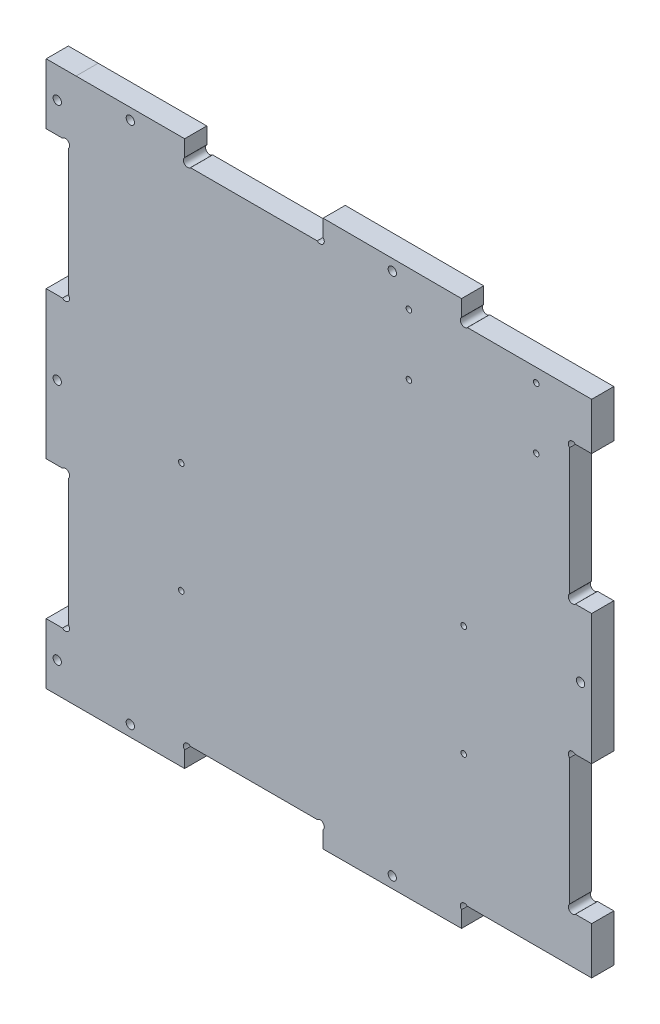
from build123d import *

# Parameters (mm, degrees)
ESQUISSE1_R        = 1
ESQUISSE1_R_2      = 1.5
ESQUISSE1_R_3      = 0.999999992
ESQUISSE1_R_4      = 0.999999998
ESQUISSE1_R_5      = 1.000000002
ESQUISSE1_R_6      = 1.499999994
ESQUISSE1_R_7      = 1.000000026
BOSS_EXTRU_1_DEPTH = 8


with BuildPart() as part:
    # Esquisse1 → Boss.-Extru.1 (new body)
    with BuildSketch(Plane.XY):
        with BuildLine():
            Line((57.310825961, 16.93251397), (11.553466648, 16.93251397))
            ThreePointArc((11.553466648, 16.93251397), (9.432146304, 16.93251397), (9.432146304, 19.053834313))
            Line((9.432146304, 19.053834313), (9.432146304, 24.932513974))
            Line((9.432146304, 24.932513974), (-29.796184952, 24.932513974))
            Line((-29.796184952, 24.932513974), (-40.567853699, 24.932512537))
            Line((-40.567853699, 24.932512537), (-40.567853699, 3.039413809))
            Line((-40.567853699, 3.039413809), (-34.68917404, 3.039413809))
            ThreePointArc((-34.68917404, 3.039413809), (-32.567718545, 3.039278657), (-32.567853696, 0.917823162))
            Line((-32.567853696, 0.917823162), (-32.567853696, -44.839349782))
            ThreePointArc((-32.567853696, -44.839349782), (-32.567853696, -46.960670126), (-34.68917404, -46.960670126))
            Line((-34.68917404, -46.960670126), (-40.567853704, -46.960670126))
            Line((-40.567853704, -46.960670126), (-40.567853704, -100.174303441))
            Line((-40.567853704, -100.174303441), (-34.68917404, -100.174303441))
            ThreePointArc((-34.68917404, -100.174303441), (-32.567853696, -100.174303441), (-32.567853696, -102.295623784))
            Line((-32.567853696, -102.295623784), (-32.567853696, -148.052796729))
            ThreePointArc((-32.567853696, -148.052796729), (-32.567718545, -150.174252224), (-34.68917404, -150.174387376))
            Line((-34.68917404, -150.174387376), (-40.567853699, -150.174387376))
            Line((-40.567853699, -150.174387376), (-40.567853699, -172.067486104))
            Line((-40.567853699, -172.067486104), (-29.796184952, -172.067487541))
            Line((-29.796184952, -172.067487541), (9.432146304, -172.067487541))
            Line((9.432146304, -172.067487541), (9.432146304, -166.18880788))
            ThreePointArc((9.432146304, -166.18880788), (9.432146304, -164.067487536), (11.553466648, -164.067487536))
            Line((11.553466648, -164.067487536), (57.310825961, -164.067487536))
            ThreePointArc((57.310825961, -164.067487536), (59.432146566, -164.067487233), (59.432146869, -166.188807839))
            Line((59.432146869, -166.188807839), (59.432146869, -172.225318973))
            Line((59.432146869, -172.225318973), (109.432146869, -172.073258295))
            Line((109.432146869, -172.073258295), (109.432146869, -166.347355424))
            Line((109.432146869, -166.347355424), (109.432146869, -166.188807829))
            ThreePointArc((109.432146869, -166.188807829), (109.432146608, -164.067487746), (111.553466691, -164.067486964))
            Line((111.553466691, -164.067486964), (156.432146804, -164.067486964))
            Line((156.432146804, -164.067486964), (156.432146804, -147.067486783))
            Line((156.432146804, -147.067486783), (150.553467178, -147.067486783))
            ThreePointArc((150.553467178, -147.067486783), (148.432146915, -147.067486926), (148.432146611, -144.946166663))
            Line((148.432146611, -144.946166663), (148.432146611, -99.188807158))
            ThreePointArc((148.432146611, -99.188807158), (148.432146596, -97.06748683), (150.553466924, -97.067486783))
            Line((150.553466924, -97.067486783), (156.432146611, -97.067486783))
            Line((156.432146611, -97.067486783), (156.432146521, -73.567486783))
            Line((156.432146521, -73.567486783), (156.432146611, -50.067486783))
            Line((156.432146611, -50.067486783), (150.553466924, -50.067486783))
            ThreePointArc((150.553466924, -50.067486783), (148.432146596, -50.067486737), (148.432146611, -47.946166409))
            Line((148.432146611, -47.946166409), (148.432146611, -2.188806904))
            ThreePointArc((148.432146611, -2.188806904), (148.432146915, -0.067486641), (150.553467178, -0.067486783))
            Line((150.553467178, -0.067486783), (156.432146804, -0.067486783))
            Line((156.432146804, -0.067486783), (156.432146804, 16.932513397))
            Line((156.432146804, 16.932513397), (111.553466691, 16.932513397))
            ThreePointArc((111.553466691, 16.932513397), (109.432146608, 16.932514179), (109.432146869, 19.053834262))
            Line((109.432146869, 19.053834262), (109.432146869, 19.212381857))
            Line((109.432146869, 19.212381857), (109.432146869, 24.938284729))
            Line((109.432146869, 24.938284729), (59.432146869, 25.090345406))
            Line((59.432146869, 25.090345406), (59.432146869, 19.053834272))
            ThreePointArc((59.432146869, 19.053834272), (59.432146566, 16.932513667), (57.310825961, 16.93251397))
        make_face()
        with Locations((136.432146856, 12.032513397)):
            Circle(ESQUISSE1_R, mode=Mode.SUBTRACT)
        with Locations((8.232146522, -77.067486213)):
            Circle(ESQUISSE1_R, mode=Mode.SUBTRACT)
        with Locations((8.232146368, -117.067486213)):
            Circle(ESQUISSE1_R, mode=Mode.SUBTRACT)
        with Locations((110.232146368, -117.067486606)):
            Circle(ESQUISSE1_R, mode=Mode.SUBTRACT)
        with Locations((84.432146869, 21.011429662)):
            Circle(ESQUISSE1_R_2, mode=Mode.SUBTRACT)
        with Locations((90.43214685, 12.032513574)):
            Circle(ESQUISSE1_R_3, mode=Mode.SUBTRACT)
        with Locations((90.432146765, -9.967486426)):
            Circle(ESQUISSE1_R_4, mode=Mode.SUBTRACT)
        with Locations((136.432146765, -9.967486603)):
            Circle(ESQUISSE1_R_5, mode=Mode.SUBTRACT)
        with Locations((-10.182019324, 20.932513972)):
            Circle(ESQUISSE1_R_2, mode=Mode.SUBTRACT)
        with Locations((-36.567819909, 13.985929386)):
            Circle(ESQUISSE1_R_2, mode=Mode.SUBTRACT)
        with Locations((-36.5678537, -73.567486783)):
            Circle(ESQUISSE1_R_6, mode=Mode.SUBTRACT)
        with Locations((-36.567819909, -161.120902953)):
            Circle(ESQUISSE1_R_2, mode=Mode.SUBTRACT)
        with Locations((110.232146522, -77.067486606)):
            Circle(ESQUISSE1_R_7, mode=Mode.SUBTRACT)
        with Locations((-10.182019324, -168.067487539)):
            Circle(ESQUISSE1_R_2, mode=Mode.SUBTRACT)
        with Locations((84.432146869, -168.146403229)):
            Circle(ESQUISSE1_R_2, mode=Mode.SUBTRACT)
        with Locations((152.432146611, -73.567486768)):
            Circle(ESQUISSE1_R_2, mode=Mode.SUBTRACT)
    extrude(amount=BOSS_EXTRU_1_DEPTH)


solid = part.part
